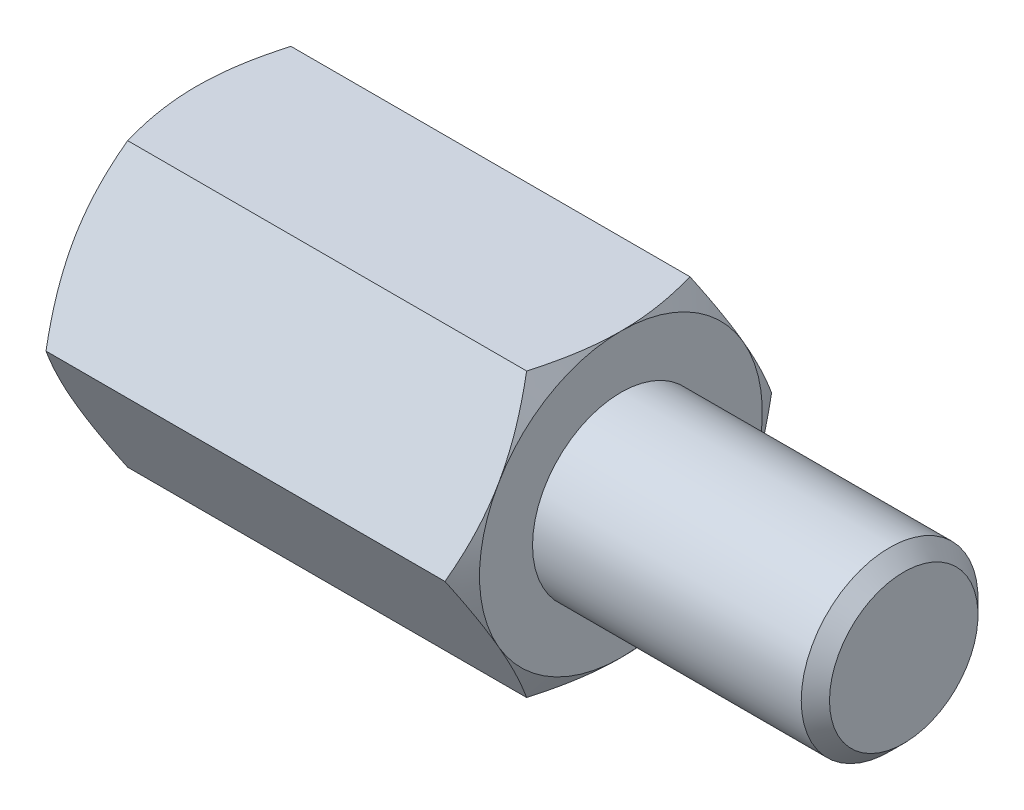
from build123d import *

# Parameters (mm, degrees)
EXTRUDE2_DEPTH = 6
SKETCH3_R      = 2.1
EXTRUDE3_DEPTH = 8
SKETCH5_R      = 2.5
EXTRUDE4_DEPTH = 8
CHAMFER1_SIZE  = 0.4


with BuildPart() as part:
    # Sketch1 → Extrude2 (new, symmetric)
    with BuildSketch(Plane(origin=(0, 0, 0), x_dir=(0, 0, -1), z_dir=(1, 0, 0))):
        Polygon((2.309401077, 4), (-2.309401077, 4), (-4.618802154, 0), (-2.309401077, -4), (2.309401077, -4), (4.618802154, 0), align=None)
    extrude(amount=EXTRUDE2_DEPTH, both=True)

    # Sketch2 → Cut-Revolve1 (revolve, cut)
    with BuildSketch(Plane.XY):
        with BuildLine():
            Line((-6, 4), (-4.5, 6.598076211))
            ThreePointArc((-4.5, 6.598076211), (-4.98810136, 7.776457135), (-6, 7))
            Line((-6, 7), (-6, 4))
        make_face()
    cut_revolve1 = revolve(axis=Axis((0, 0, 0), (1, 0, 0)), mode=Mode.SUBTRACT)

    # Mirror1: Cut-Revolve1 across plane
    add(cut_revolve1.mirror(Plane(origin=(0, 0, 0), x_dir=(0, 0, 1), z_dir=(1, 0, 0))), mode=Mode.SUBTRACT)

    # Sketch3 → Extrude3 (cut)
    with BuildSketch(Plane.ZY.offset(6)):
        Circle(SKETCH3_R)
    extrude(amount=-EXTRUDE3_DEPTH, mode=Mode.SUBTRACT)

    # Sketch4 → Cut-Revolve2 (revolve, cut)
    with BuildSketch(Plane.XY, mode=Mode.PRIVATE) as cut_revolve2_sk:
        Polygon((2, 0), (2, 2.1), (3.212435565, 0), align=None)
    revolve(cut_revolve2_sk.sketch.rotate(Axis((3.212435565, 0, 0), (-1, 0, 0)), 270), axis=Axis((3.212435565, 0, 0), (-1, 0, 0)), mode=Mode.SUBTRACT)

    # Sketch5 → Extrude4 (add)
    with BuildSketch(Plane(origin=(6, 0, 0), x_dir=(0, 0, -1), z_dir=(1, 0, 0))):
        Circle(SKETCH5_R)
    extrude(amount=EXTRUDE4_DEPTH)

    # Chamfer1
    chamfer1_edges = [part.edges().sort_by_distance(p)[0] for p in [
        (14, 0, 2.5),
    ]]
    chamfer(chamfer1_edges, length=CHAMFER1_SIZE)


solid = part.part
